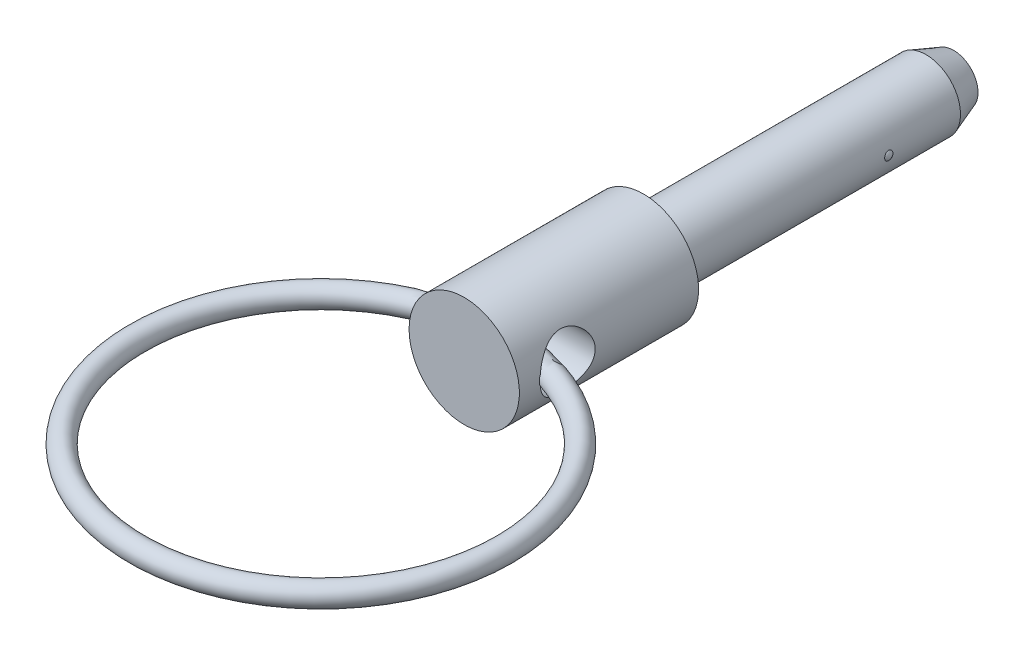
ISO-10303-21;
HEADER;
FILE_DESCRIPTION(('STEP AP214'),'2;1');
FILE_NAME('part.step','',(''),(''),'','','');
FILE_SCHEMA(('AUTOMOTIVE_DESIGN { 1 0 10303 214 1 1 1 1 }'));
ENDSEC;
DATA;
#1=APPLICATION_CONTEXT('core data for automotive mechanical design processes');
#2=APPLICATION_PROTOCOL_DEFINITION('international standard','automotive_design',2000,#1);
#3=PRODUCT_CONTEXT('',#1,'mechanical');
#4=PRODUCT('Part','Part','',(#3));
#5=PRODUCT_RELATED_PRODUCT_CATEGORY('part','',(#4));
#6=PRODUCT_DEFINITION_FORMATION('','',#4);
#7=PRODUCT_DEFINITION_CONTEXT('part definition',#1,'design');
#8=PRODUCT_DEFINITION('design','',#6,#7);
#9=PRODUCT_DEFINITION_SHAPE('','',#8);
#10=(LENGTH_UNIT() NAMED_UNIT(*) SI_UNIT(.MILLI.,.METRE.));
#11=(NAMED_UNIT(*) PLANE_ANGLE_UNIT() SI_UNIT($,.RADIAN.));
#12=(NAMED_UNIT(*) SI_UNIT($,.STERADIAN.) SOLID_ANGLE_UNIT());
#13=UNCERTAINTY_MEASURE_WITH_UNIT(LENGTH_MEASURE(1.E-05),#10,'distance_accuracy_value','');
#14=(GEOMETRIC_REPRESENTATION_CONTEXT(3) GLOBAL_UNCERTAINTY_ASSIGNED_CONTEXT((#13)) GLOBAL_UNIT_ASSIGNED_CONTEXT((#10,
#11,#12)) REPRESENTATION_CONTEXT('',''));
#15=CARTESIAN_POINT('',(0.,0.,0.));
#16=DIRECTION('',(0.,0.,1.));
#17=DIRECTION('',(1.,0.,0.));
#18=AXIS2_PLACEMENT_3D('',#15,#16,#17);
#19=CARTESIAN_POINT('',(0.,0.,14.9758741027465));
#20=DIRECTION('',(0.,0.,1.));
#21=DIRECTION('',(-1.,0.,0.));
#22=AXIS2_PLACEMENT_3D('',#19,#20,#21);
#23=CYLINDRICAL_SURFACE('',#22,4.00000000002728);
#24=CARTESIAN_POINT('',(0.,0.,12.9999999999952));
#25=DIRECTION('',(0.,0.,1.));
#26=DIRECTION('',(-1.,0.,0.));
#27=AXIS2_PLACEMENT_3D('',#24,#25,#26);
#28=CIRCLE('',#27,4.00000000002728);
#29=CARTESIAN_POINT('',(-4.00000000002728,0.,12.9999999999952));
#30=VERTEX_POINT('',#29);
#31=EDGE_CURVE('E68',#30,#30,#28,.T.);
#32=ORIENTED_EDGE('',*,*,#31,.F.);
#33=EDGE_LOOP('',(#32));
#34=FACE_BOUND('',#33,.T.);
#35=CARTESIAN_POINT('',(0.,0.,2.90531487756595E-11));
#36=DIRECTION('',(0.,0.,1.));
#37=DIRECTION('',(-1.,0.,0.));
#38=AXIS2_PLACEMENT_3D('',#35,#36,#37);
#39=CIRCLE('',#38,4.00000000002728);
#40=CARTESIAN_POINT('',(-4.00000000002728,0.,2.90531487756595E-11));
#41=VERTEX_POINT('',#40);
#42=EDGE_CURVE('E119',#41,#41,#39,.T.);
#43=ORIENTED_EDGE('',*,*,#42,.T.);
#44=EDGE_LOOP('',(#43));
#45=FACE_BOUND('',#44,.T.);
#46=CARTESIAN_POINT('',(3.99005038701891,0.281953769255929,9.92986493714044));
#47=CARTESIAN_POINT('',(3.98710361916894,0.323646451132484,9.94537015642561));
#48=CARTESIAN_POINT('',(3.98358785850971,0.364031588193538,9.96435084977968));
#49=CARTESIAN_POINT('',(3.97580260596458,0.441017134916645,10.008790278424));
#50=CARTESIAN_POINT('',(3.97153248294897,0.47761433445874,10.0342544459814));
#51=CARTESIAN_POINT('',(3.96271650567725,0.545954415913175,10.0909789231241));
#52=CARTESIAN_POINT('',(3.95817071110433,0.577698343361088,10.1222379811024));
#53=CARTESIAN_POINT('',(3.94931125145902,0.635450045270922,10.1896824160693));
#54=CARTESIAN_POINT('',(3.94499753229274,0.661459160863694,10.2258666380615));
#55=CARTESIAN_POINT('',(3.93708131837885,0.707055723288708,10.3020868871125));
#56=CARTESIAN_POINT('',(3.93347801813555,0.726650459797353,10.3421184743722));
#57=CARTESIAN_POINT('',(3.92735611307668,0.759043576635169,10.4249158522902));
#58=CARTESIAN_POINT('',(3.92483759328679,0.771841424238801,10.4676818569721));
#59=CARTESIAN_POINT('',(3.92109281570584,0.79064892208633,10.5555243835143));
#60=CARTESIAN_POINT('',(3.91989028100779,0.79653409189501,10.6006284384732));
#61=CARTESIAN_POINT('',(3.91894269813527,0.801182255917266,10.6912124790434));
#62=CARTESIAN_POINT('',(3.91919799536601,0.79994356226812,10.7366925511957));
#63=CARTESIAN_POINT('',(3.92114297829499,0.79035624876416,10.829192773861));
#64=CARTESIAN_POINT('',(3.92290466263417,0.781650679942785,10.8761742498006));
#65=CARTESIAN_POINT('',(3.92772482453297,0.757055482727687,10.9681516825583));
#66=CARTESIAN_POINT('',(3.93078377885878,0.741163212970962,11.0131469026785));
#67=CARTESIAN_POINT('',(3.93806499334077,0.70148030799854,11.1026764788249));
#68=CARTESIAN_POINT('',(3.94234583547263,0.677274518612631,11.1470226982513));
#69=CARTESIAN_POINT('',(3.95147153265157,0.621820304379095,11.2310343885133));
#70=CARTESIAN_POINT('',(3.95631656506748,0.590569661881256,11.2706983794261));
#71=CARTESIAN_POINT('',(3.9660181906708,0.5214609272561,11.3441933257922));
#72=CARTESIAN_POINT('',(3.97087472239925,0.483570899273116,11.3779944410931));
#73=CARTESIAN_POINT('',(3.97994547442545,0.402125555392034,11.4380257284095));
#74=CARTESIAN_POINT('',(3.98416017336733,0.358574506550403,11.4642615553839));
#75=CARTESIAN_POINT('',(3.99101820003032,0.271145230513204,11.5057266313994));
#76=CARTESIAN_POINT('',(3.99376828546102,0.227643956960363,11.5217298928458));
#77=CARTESIAN_POINT('',(3.9978554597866,0.138347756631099,11.5452375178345));
#78=CARTESIAN_POINT('',(3.99919394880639,0.0925551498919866,11.5527503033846));
#79=CARTESIAN_POINT('',(4.00020492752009,0.00564920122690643,11.5584330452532));
#80=CARTESIAN_POINT('',(4.00005022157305,-0.0354012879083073,11.5575719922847));
#81=CARTESIAN_POINT('',(3.99850330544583,-0.116721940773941,11.5488508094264));
#82=CARTESIAN_POINT('',(3.99711125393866,-0.156992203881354,11.5409915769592));
#83=CARTESIAN_POINT('',(3.99330536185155,-0.23447092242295,11.5190218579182));
#84=CARTESIAN_POINT('',(3.99092186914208,-0.271733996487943,11.5050965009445));
#85=CARTESIAN_POINT('',(3.98537855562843,-0.343596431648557,11.4716692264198));
#86=CARTESIAN_POINT('',(3.98221855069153,-0.378195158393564,11.4521659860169));
#87=CARTESIAN_POINT('',(3.97515535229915,-0.446551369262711,11.4066625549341));
#88=CARTESIAN_POINT('',(3.97121432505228,-0.48005403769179,11.380286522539));
#89=CARTESIAN_POINT('',(3.96314004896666,-0.542697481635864,11.3228119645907));
#90=CARTESIAN_POINT('',(3.95900671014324,-0.57183618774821,11.2917112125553));
#91=CARTESIAN_POINT('',(3.95044956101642,-0.628376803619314,11.2218573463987));
#92=CARTESIAN_POINT('',(3.94604615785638,-0.655204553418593,11.1826362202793));
#93=CARTESIAN_POINT('',(3.93791011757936,-0.702452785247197,11.1004353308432));
#94=CARTESIAN_POINT('',(3.93417778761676,-0.722870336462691,11.0574538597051));
#95=CARTESIAN_POINT('',(3.92755557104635,-0.758058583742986,10.9655943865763));
#96=CARTESIAN_POINT('',(3.92474503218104,-0.77232094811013,10.9165145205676));
#97=CARTESIAN_POINT('',(3.92073635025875,-0.792422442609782,10.8165862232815));
#98=CARTESIAN_POINT('',(3.91953811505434,-0.79826205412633,10.765737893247));
#99=CARTESIAN_POINT('',(3.91896964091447,-0.801049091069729,10.6645522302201));
#100=CARTESIAN_POINT('',(3.91957166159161,-0.798131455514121,10.6142190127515));
#101=CARTESIAN_POINT('',(3.92252995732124,-0.783463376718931,10.5149080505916));
#102=CARTESIAN_POINT('',(3.9248854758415,-0.771716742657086,10.4659297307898));
#103=CARTESIAN_POINT('',(3.93088557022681,-0.740520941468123,10.3740211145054));
#104=CARTESIAN_POINT('',(3.93443961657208,-0.721603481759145,10.3309041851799));
#105=CARTESIAN_POINT('',(3.94243966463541,-0.67652841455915,10.2487285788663));
#106=CARTESIAN_POINT('',(3.94688545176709,-0.650372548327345,10.2096689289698));
#107=CARTESIAN_POINT('',(3.95592540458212,-0.592842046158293,10.138445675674));
#108=CARTESIAN_POINT('',(3.96050463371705,-0.561744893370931,10.1060555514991));
#109=CARTESIAN_POINT('',(3.96946431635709,-0.494471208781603,10.0470379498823));
#110=CARTESIAN_POINT('',(3.97384478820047,-0.458295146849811,10.0204099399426));
#111=CARTESIAN_POINT('',(3.98187371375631,-0.382266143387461,9.97385565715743));
#112=CARTESIAN_POINT('',(3.98552868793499,-0.342451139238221,9.95386848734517));
#113=CARTESIAN_POINT('',(3.9917566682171,-0.259975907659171,9.92075319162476));
#114=CARTESIAN_POINT('',(3.99432946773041,-0.217315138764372,9.90762637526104));
#115=CARTESIAN_POINT('',(3.99811926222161,-0.130195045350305,9.88852098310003));
#116=CARTESIAN_POINT('',(3.99933102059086,-0.0857294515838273,9.88257000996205));
#117=CARTESIAN_POINT('',(4.00024701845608,0.00356373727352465,9.87805708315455));
#118=CARTESIAN_POINT('',(3.9999525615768,0.0483909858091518,9.8794887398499));
#119=CARTESIAN_POINT('',(3.99817522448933,0.125082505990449,9.88829599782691));
#120=CARTESIAN_POINT('',(3.99703656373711,0.157163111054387,9.8939529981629));
#121=CARTESIAN_POINT('',(3.99404982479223,0.220379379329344,9.90907748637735));
#122=CARTESIAN_POINT('',(3.9922017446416,0.251515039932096,9.91854498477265));
#123=CARTESIAN_POINT('',(3.99005038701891,0.281953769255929,9.92986493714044));
#124=B_SPLINE_CURVE_WITH_KNOTS('',3,(#46,#47,#48,#49,#50,#51,#52,#53,#54,#55,#56,#57,#58,#59,
#60,#61,#62,#63,#64,#65,#66,#67,#68,#69,#70,#71,#72,#73,#74,#75,#76,#77,#78,#79,#80,#81,#82,#83,
#84,#85,#86,#87,#88,#89,#90,#91,#92,#93,#94,#95,#96,#97,#98,#99,#100,#101,#102,#103,#104,#105,
#106,#107,#108,#109,#110,#111,#112,#113,#114,#115,#116,#117,#118,#119,#120,#121,#122,#123),
.UNSPECIFIED.,.T.,.F.,(4,2,2,2,2,2,2,2,2,2,2,2,2,2,2,2,2,2,2,2,2,2,2,2,2,2,2,2,2,2,2,2,2,2,2,2,
2,2,4),(0.,0.13362272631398,0.267357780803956,0.40106398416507,0.534738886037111,
0.668261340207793,0.801794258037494,0.937696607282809,1.07363115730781,1.2164509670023,
1.35932331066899,1.5107314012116,1.66218722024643,1.8143926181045,1.96648394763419,
2.1049852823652,2.24334911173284,2.36591145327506,2.488458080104,2.60750142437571,
2.72657302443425,2.85451767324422,2.98252280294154,3.12508196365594,3.26770620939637,
3.42053145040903,3.57334795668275,3.72382188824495,3.87423093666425,4.01516707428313,
4.15606933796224,4.29082406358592,4.42556633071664,4.55903651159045,4.69253216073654,
4.82653969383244,4.96043126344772,5.05798542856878,5.15553986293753),.UNSPECIFIED.);
#125=CARTESIAN_POINT('',(3.98515545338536,0.344290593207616,11.4701431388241));
#126=VERTEX_POINT('',#125);
#127=CARTESIAN_POINT('',(3.9851554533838,-0.344290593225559,11.4701431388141));
#128=VERTEX_POINT('',#127);
#129=EDGE_CURVE('E40',#126,#128,#124,.T.);
#130=ORIENTED_EDGE('',*,*,#129,.F.);
#131=CARTESIAN_POINT('',(3.46410161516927,-2.,9.5));
#132=CARTESIAN_POINT('',(3.46411185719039,-1.99999158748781,9.39578679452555));
#133=CARTESIAN_POINT('',(3.46887633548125,-1.99179963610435,9.29143782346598));
#134=CARTESIAN_POINT('',(3.48724701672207,-1.95944672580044,9.08594482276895));
#135=CARTESIAN_POINT('',(3.50087179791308,-1.93525221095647,8.98480799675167));
#136=CARTESIAN_POINT('',(3.53498701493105,-1.87219981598,8.78909684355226));
#137=CARTESIAN_POINT('',(3.55544089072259,-1.83341988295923,8.69449074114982));
#138=CARTESIAN_POINT('',(3.60085327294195,-1.74253507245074,8.51315154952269));
#139=CARTESIAN_POINT('',(3.62581202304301,-1.6904294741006,8.42641888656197));
#140=CARTESIAN_POINT('',(3.679937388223,-1.56933307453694,8.25538855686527));
#141=CARTESIAN_POINT('',(3.70928127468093,-1.49930407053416,8.1718817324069));
#142=CARTESIAN_POINT('',(3.76743965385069,-1.34650761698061,8.01718321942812));
#143=CARTESIAN_POINT('',(3.79625387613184,-1.26373385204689,7.94599767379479));
#144=CARTESIAN_POINT('',(3.8524295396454,-1.080979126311,7.81326569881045));
#145=CARTESIAN_POINT('',(3.879562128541,-0.980214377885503,7.75269246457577));
#146=CARTESIAN_POINT('',(3.92701512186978,-0.768314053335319,7.64971829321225));
#147=CARTESIAN_POINT('',(3.94733982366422,-0.657185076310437,7.60730588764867));
#148=CARTESIAN_POINT('',(3.97760922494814,-0.436089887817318,7.54499067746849));
#149=CARTESIAN_POINT('',(3.98818960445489,-0.326603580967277,7.52370094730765));
#150=CARTESIAN_POINT('',(4.00015167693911,-0.105141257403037,7.49966776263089));
#151=CARTESIAN_POINT('',(4.00153893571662,0.00683321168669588,7.49691308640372));
#152=CARTESIAN_POINT('',(3.99525963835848,0.21966504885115,7.50949334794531));
#153=CARTESIAN_POINT('',(3.98836991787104,0.320642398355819,7.5232760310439));
#154=CARTESIAN_POINT('',(3.96748490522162,0.51862754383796,7.56576168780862));
#155=CARTESIAN_POINT('',(3.95348908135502,0.615635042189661,7.59446577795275));
#156=CARTESIAN_POINT('',(3.91943166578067,0.804618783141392,7.66616513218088));
#157=CARTESIAN_POINT('',(3.89928883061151,0.896506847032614,7.70935262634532));
#158=CARTESIAN_POINT('',(3.85475291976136,1.07195360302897,7.80852683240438));
#159=CARTESIAN_POINT('',(3.83035832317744,1.15550929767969,7.86451812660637));
#160=CARTESIAN_POINT('',(3.77688788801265,1.32034732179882,7.99379070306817));
#161=CARTESIAN_POINT('',(3.74758751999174,1.40066815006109,8.06820605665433));
#162=CARTESIAN_POINT('',(3.68908681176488,1.54820874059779,8.22917944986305));
#163=CARTESIAN_POINT('',(3.65988656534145,1.6154184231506,8.31574674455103));
#164=CARTESIAN_POINT('',(3.60288312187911,1.73901066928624,8.50529638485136));
#165=CARTESIAN_POINT('',(3.57528639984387,1.79443462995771,8.60897204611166));
#166=CARTESIAN_POINT('',(3.52750900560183,1.88663822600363,8.82587534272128));
#167=CARTESIAN_POINT('',(3.50732060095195,1.92343731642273,8.9390928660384));
#168=CARTESIAN_POINT('',(3.47889271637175,1.97436042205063,9.1624290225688));
#169=CARTESIAN_POINT('',(3.46983311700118,1.99005024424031,9.27208223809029));
#170=CARTESIAN_POINT('',(3.46235838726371,2.00303389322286,9.49280268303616));
#171=CARTESIAN_POINT('',(3.46393573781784,2.00034071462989,9.60386885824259));
#172=CARTESIAN_POINT('',(3.47668673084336,1.97807208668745,9.81130783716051));
#173=CARTESIAN_POINT('',(3.48679175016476,1.96037563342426,9.90795890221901));
#174=CARTESIAN_POINT('',(3.51388043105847,1.91139256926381,10.0967355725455));
#175=CARTESIAN_POINT('',(3.5308663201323,1.88010155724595,10.1888597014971));
#176=CARTESIAN_POINT('',(3.57072444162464,1.80329517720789,10.370822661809));
#177=CARTESIAN_POINT('',(3.59383286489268,1.75718812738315,10.46035803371));
#178=CARTESIAN_POINT('',(3.64312238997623,1.65257412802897,10.6309385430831));
#179=CARTESIAN_POINT('',(3.66930506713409,1.59406080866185,10.7119792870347));
#180=CARTESIAN_POINT('',(3.72575996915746,1.45767433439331,10.8739575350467));
#181=CARTESIAN_POINT('',(3.75613166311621,1.37829054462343,10.9535943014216));
#182=CARTESIAN_POINT('',(3.81468469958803,1.20680899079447,11.0988244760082));
#183=CARTESIAN_POINT('',(3.84286530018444,1.11470694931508,11.1644131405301));
#184=CARTESIAN_POINT('',(3.89482723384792,0.917070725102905,11.2811474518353));
#185=CARTESIAN_POINT('',(3.91847283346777,0.811246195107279,11.3318662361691));
#186=CARTESIAN_POINT('',(3.95766709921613,0.591044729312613,11.4142758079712));
#187=CARTESIAN_POINT('',(3.97322287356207,0.476675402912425,11.4459833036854));
#188=CARTESIAN_POINT('',(3.99335016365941,0.253959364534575,11.4867371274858));
#189=CARTESIAN_POINT('',(3.99879855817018,0.146022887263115,11.4975957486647));
#190=CARTESIAN_POINT('',(4.00084260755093,-0.0702519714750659,11.5016865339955));
#191=CARTESIAN_POINT('',(3.99744136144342,-0.178590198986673,11.4949248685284));
#192=CARTESIAN_POINT('',(3.98267937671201,-0.385075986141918,11.4651671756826));
#193=CARTESIAN_POINT('',(3.97185789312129,-0.483424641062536,11.4432702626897));
#194=CARTESIAN_POINT('',(3.94384187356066,-0.674891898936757,11.3853460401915));
#195=CARTESIAN_POINT('',(3.92664642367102,-0.768009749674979,11.3493167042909));
#196=CARTESIAN_POINT('',(3.88651861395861,-0.950846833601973,11.2625457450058));
#197=CARTESIAN_POINT('',(3.86337234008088,-1.04025036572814,11.211240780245));
#198=CARTESIAN_POINT('',(3.81376266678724,-1.20954920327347,11.096084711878));
#199=CARTESIAN_POINT('',(3.78729774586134,-1.28944011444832,11.0322278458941));
#200=CARTESIAN_POINT('',(3.73057218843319,-1.44582833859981,10.8864033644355));
#201=CARTESIAN_POINT('',(3.70019591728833,-1.52119665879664,10.8032658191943));
#202=CARTESIAN_POINT('',(3.64126158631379,-1.65732528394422,10.6251077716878));
#203=CARTESIAN_POINT('',(3.6127051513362,-1.71807266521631,10.530076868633));
#204=CARTESIAN_POINT('',(3.55999186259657,-1.82486714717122,10.3266911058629));
#205=CARTESIAN_POINT('',(3.5360025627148,-1.8703890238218,10.2180100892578));
#206=CARTESIAN_POINT('',(3.50696218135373,-1.92395929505,10.0494218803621));
#207=CARTESIAN_POINT('',(3.49844389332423,-1.93935666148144,9.99235217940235));
#208=CARTESIAN_POINT('',(3.48406059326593,-1.96508069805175,9.87676744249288));
#209=CARTESIAN_POINT('',(3.47819372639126,-1.97541091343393,9.81825344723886));
#210=CARTESIAN_POINT('',(3.47059023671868,-1.9887293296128,9.71639921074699));
#211=CARTESIAN_POINT('',(3.46816389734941,-1.99295091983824,9.67326694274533));
#212=CARTESIAN_POINT('',(3.46491740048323,-1.99858810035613,9.5867643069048));
#213=CARTESIAN_POINT('',(3.46409735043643,-2.00000350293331,9.54339392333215));
#214=CARTESIAN_POINT('',(3.46410161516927,-2.,9.5));
#215=B_SPLINE_CURVE_WITH_KNOTS('',3,(#131,#132,#133,#134,#135,#136,#137,#138,#139,#140,#141,
#142,#143,#144,#145,#146,#147,#148,#149,#150,#151,#152,#153,#154,#155,#156,#157,#158,#159,#160,
#161,#162,#163,#164,#165,#166,#167,#168,#169,#170,#171,#172,#173,#174,#175,#176,#177,#178,#179,
#180,#181,#182,#183,#184,#185,#186,#187,#188,#189,#190,#191,#192,#193,#194,#195,#196,#197,#198,
#199,#200,#201,#202,#203,#204,#205,#206,#207,#208,#209,#210,#211,#212,#213,#214),.UNSPECIFIED.,
.T.,.F.,(4,2,2,2,2,2,2,2,2,2,2,2,2,2,2,2,2,2,2,2,2,2,2,2,2,2,2,2,2,2,2,2,2,2,2,2,2,2,2,2,2,4),
(0.,0.312464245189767,0.625585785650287,0.937057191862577,1.24854545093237,1.58572462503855,
1.92307142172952,2.283157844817,2.64301653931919,2.97726969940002,3.31132047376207,
3.61632194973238,3.92134625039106,4.23059069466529,4.53994598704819,4.87854382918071,
5.21740096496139,5.57777683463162,5.93777548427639,6.26924581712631,6.60048186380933,
6.89548366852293,7.19058104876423,7.49934592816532,7.80826972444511,8.15613487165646,
8.50411729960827,8.8612836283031,9.21813559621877,9.54224540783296,9.86624173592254,
10.1688884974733,10.4715786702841,10.7872150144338,11.1029966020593,11.4502048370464,
11.7977188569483,12.1562149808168,12.3351395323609,12.513938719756,12.6440387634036,
12.7741475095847),.UNSPECIFIED.);
#216=EDGE_CURVE('E52',#128,#126,#215,.T.);
#217=ORIENTED_EDGE('',*,*,#216,.F.);
#218=EDGE_LOOP('',(#130,#217));
#219=FACE_BOUND('',#218,.T.);
#220=CARTESIAN_POINT('',(-3.99005038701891,0.28195376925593,9.92986493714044));
#221=CARTESIAN_POINT('',(-3.99300741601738,0.240095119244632,9.91430139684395));
#222=CARTESIAN_POINT('',(-3.99539394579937,0.196873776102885,9.90222423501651));
#223=CARTESIAN_POINT('',(-3.99875840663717,0.10894998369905,9.88535960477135));
#224=CARTESIAN_POINT('',(-3.99973502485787,0.0642461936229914,9.88057893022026));
#225=CARTESIAN_POINT('',(-4.00017032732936,-0.025331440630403,9.87843698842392));
#226=CARTESIAN_POINT('',(-3.99962961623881,-0.0702052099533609,9.88107276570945));
#227=CARTESIAN_POINT('',(-3.99709040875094,-0.158855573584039,9.89369477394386));
#228=CARTESIAN_POINT('',(-3.99509218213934,-0.202632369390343,9.90367964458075));
#229=CARTESIAN_POINT('',(-3.9898570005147,-0.287863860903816,9.93075746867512));
#230=CARTESIAN_POINT('',(-3.98661975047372,-0.329318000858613,9.94785211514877));
#231=CARTESIAN_POINT('',(-3.97926488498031,-0.408707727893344,9.98872052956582));
#232=CARTESIAN_POINT('',(-3.97514726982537,-0.446643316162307,10.0124942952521));
#233=CARTESIAN_POINT('',(-3.96650501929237,-0.517804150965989,10.0660180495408));
#234=CARTESIAN_POINT('',(-3.96198162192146,-0.551042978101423,10.0957501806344));
#235=CARTESIAN_POINT('',(-3.95302385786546,-0.612008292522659,10.1604189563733));
#236=CARTESIAN_POINT('',(-3.94858948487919,-0.639735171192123,10.1953552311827));
#237=CARTESIAN_POINT('',(-3.94031345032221,-0.688877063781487,10.2693392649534));
#238=CARTESIAN_POINT('',(-3.93647024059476,-0.710308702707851,10.3083758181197));
#239=CARTESIAN_POINT('',(-3.92977370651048,-0.746470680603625,10.3895111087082));
#240=CARTESIAN_POINT('',(-3.92692040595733,-0.761200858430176,10.4316099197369));
#241=CARTESIAN_POINT('',(-3.92245555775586,-0.783887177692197,10.5182713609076));
#242=CARTESIAN_POINT('',(-3.92086162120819,-0.791747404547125,10.5628599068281));
#243=CARTESIAN_POINT('',(-3.91911143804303,-0.800365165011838,10.652740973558));
#244=CARTESIAN_POINT('',(-3.91895550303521,-0.80112115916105,10.698033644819));
#245=CARTESIAN_POINT('',(-3.92007796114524,-0.795611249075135,10.7902748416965));
#246=CARTESIAN_POINT('',(-3.92142316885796,-0.789018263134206,10.837202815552));
#247=CARTESIAN_POINT('',(-3.92546548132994,-0.768652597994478,10.9294151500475));
#248=CARTESIAN_POINT('',(-3.92816306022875,-0.754877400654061,10.9746989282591));
#249=CARTESIAN_POINT('',(-3.93479992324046,-0.719508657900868,11.0652695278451));
#250=CARTESIAN_POINT('',(-3.93880557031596,-0.697485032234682,11.1103840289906));
#251=CARTESIAN_POINT('',(-3.94752061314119,-0.646337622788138,11.196342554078));
#252=CARTESIAN_POINT('',(-3.95223026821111,-0.617211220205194,11.2371849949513));
#253=CARTESIAN_POINT('',(-3.96188534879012,-0.551879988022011,11.3139586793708));
#254=CARTESIAN_POINT('',(-3.96683340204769,-0.515564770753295,11.349796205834));
#255=CARTESIAN_POINT('',(-3.97625988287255,-0.43694196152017,11.414255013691));
#256=CARTESIAN_POINT('',(-3.98073857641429,-0.394637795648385,11.4428803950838));
#257=CARTESIAN_POINT('',(-3.98829005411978,-0.30863677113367,11.4895001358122));
#258=CARTESIAN_POINT('',(-3.99144495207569,-0.265302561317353,11.5081469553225));
#259=CARTESIAN_POINT('',(-3.99638413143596,-0.175817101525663,11.5368761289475));
#260=CARTESIAN_POINT('',(-3.99816989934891,-0.129668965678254,11.5469677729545));
#261=CARTESIAN_POINT('',(-3.99999419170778,-0.0417967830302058,11.5572584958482));
#262=CARTESIAN_POINT('',(-4.00021432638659,-0.000194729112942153,11.5584860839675));
#263=CARTESIAN_POINT('',(-3.99936155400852,0.0825703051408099,11.5536924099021));
#264=CARTESIAN_POINT('',(-3.9982889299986,0.123733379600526,11.5476727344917));
#265=CARTESIAN_POINT('',(-3.99505363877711,0.202575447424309,11.5291543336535));
#266=CARTESIAN_POINT('',(-3.99294152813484,0.24032798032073,11.5169554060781));
#267=CARTESIAN_POINT('',(-3.98787194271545,0.31340150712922,11.4868260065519));
#268=CARTESIAN_POINT('',(-3.98491430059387,0.348722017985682,11.4688943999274));
#269=CARTESIAN_POINT('',(-3.97822434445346,0.418368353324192,11.4267056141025));
#270=CARTESIAN_POINT('',(-3.9744550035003,0.452491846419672,11.4021214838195));
#271=CARTESIAN_POINT('',(-3.96662805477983,0.516631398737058,11.3481231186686));
#272=CARTESIAN_POINT('',(-3.96257031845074,0.546645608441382,11.3187067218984));
#273=CARTESIAN_POINT('',(-3.9540631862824,0.605276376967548,11.2522992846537));
#274=CARTESIAN_POINT('',(-3.94962143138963,0.633350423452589,11.214827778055));
#275=CARTESIAN_POINT('',(-3.9412701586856,0.68339933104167,11.135950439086));
#276=CARTESIAN_POINT('',(-3.93736090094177,0.705371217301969,11.0945427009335));
#277=CARTESIAN_POINT('',(-3.93019522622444,0.744305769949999,11.0052774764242));
#278=CARTESIAN_POINT('',(-3.9270182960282,0.760712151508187,10.9571694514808));
#279=CARTESIAN_POINT('',(-3.92216984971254,0.785329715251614,10.8588172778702));
#280=CARTESIAN_POINT('',(-3.92049838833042,0.793540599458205,10.8085730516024));
#281=CARTESIAN_POINT('',(-3.91892501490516,0.801276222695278,10.7075574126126));
#282=CARTESIAN_POINT('',(-3.91901674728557,0.800832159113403,10.6567885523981));
#283=CARTESIAN_POINT('',(-3.92100845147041,0.791023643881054,10.5561554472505));
#284=CARTESIAN_POINT('',(-3.9229076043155,0.7816632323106,10.5062908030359));
#285=CARTESIAN_POINT('',(-3.9281461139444,0.754877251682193,10.4121456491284));
#286=CARTESIAN_POINT('',(-3.93139064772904,0.737977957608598,10.3677100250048));
#287=CARTESIAN_POINT('',(-3.93892368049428,0.696648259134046,10.2825763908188));
#288=CARTESIAN_POINT('',(-3.94321208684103,0.672218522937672,10.2418780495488));
#289=CARTESIAN_POINT('',(-3.95208501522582,0.617853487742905,10.1674080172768));
#290=CARTESIAN_POINT('',(-3.95664517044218,0.588241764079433,10.1333964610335));
#291=CARTESIAN_POINT('',(-3.96570971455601,0.523645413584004,10.0709664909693));
#292=CARTESIAN_POINT('',(-3.97021415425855,0.488666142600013,10.0425425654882));
#293=CARTESIAN_POINT('',(-3.97742706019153,0.425180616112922,9.99940040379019));
#294=CARTESIAN_POINT('',(-3.9802769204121,0.39774932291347,9.98310007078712));
#295=CARTESIAN_POINT('',(-3.98553180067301,0.341095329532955,9.95389443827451));
#296=CARTESIAN_POINT('',(-3.9879368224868,0.311872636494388,9.94098912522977));
#297=CARTESIAN_POINT('',(-3.99005038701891,0.28195376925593,9.92986493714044));
#298=B_SPLINE_CURVE_WITH_KNOTS('',3,(#220,#221,#222,#223,#224,#225,#226,#227,#228,#229,#230,
#231,#232,#233,#234,#235,#236,#237,#238,#239,#240,#241,#242,#243,#244,#245,#246,#247,#248,#249,
#250,#251,#252,#253,#254,#255,#256,#257,#258,#259,#260,#261,#262,#263,#264,#265,#266,#267,#268,
#269,#270,#271,#272,#273,#274,#275,#276,#277,#278,#279,#280,#281,#282,#283,#284,#285,#286,#287,
#288,#289,#290,#291,#292,#293,#294,#295,#296,#297),.UNSPECIFIED.,.T.,.F.,(4,2,2,2,2,2,2,2,2,2,2,
2,2,2,2,2,2,2,2,2,2,2,2,2,2,2,2,2,2,2,2,2,2,2,2,2,2,2,4),(0.,0.134152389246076,
0.268429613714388,0.402653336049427,0.536852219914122,0.671083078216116,0.805313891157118,
0.939148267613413,1.07297313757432,1.20644134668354,1.33991276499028,1.4752191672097,
1.61055488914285,1.75216328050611,1.89382135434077,2.04422271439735,2.19467961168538,
2.34765655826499,2.50054634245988,2.64157513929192,2.78245059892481,2.90667081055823,
3.03086382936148,3.14953805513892,3.26823578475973,3.39440010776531,3.52062102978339,
3.66112536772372,3.80169808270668,3.95376166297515,4.10583077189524,4.25735183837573,
4.4088042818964,4.55102684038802,4.6932367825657,4.82856596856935,4.96376098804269,
5.05964806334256,5.15553475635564),.UNSPECIFIED.);
#299=CARTESIAN_POINT('',(-3.98515545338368,-0.344290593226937,11.4701431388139));
#300=VERTEX_POINT('',#299);
#301=CARTESIAN_POINT('',(-3.98515545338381,0.344290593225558,11.4701431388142));
#302=VERTEX_POINT('',#301);
#303=EDGE_CURVE('E56',#300,#302,#298,.T.);
#304=ORIENTED_EDGE('',*,*,#303,.F.);
#305=CARTESIAN_POINT('',(-4.00000000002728,0.,7.5));
#306=CARTESIAN_POINT('',(-3.9999942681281,-0.105143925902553,7.50000660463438));
#307=CARTESIAN_POINT('',(-3.99580982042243,-0.2104131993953,7.50834014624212));
#308=CARTESIAN_POINT('',(-3.97948312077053,-0.417840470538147,7.54130576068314));
#309=CARTESIAN_POINT('',(-3.96732575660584,-0.519992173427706,7.56596878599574));
#310=CARTESIAN_POINT('',(-3.93632558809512,-0.717867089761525,7.63038761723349));
#311=CARTESIAN_POINT('',(-3.91750878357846,-0.81361360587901,7.67008476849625));
#312=CARTESIAN_POINT('',(-3.87491553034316,-0.996945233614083,7.76314124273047));
#313=CARTESIAN_POINT('',(-3.85113947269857,-1.08453098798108,7.81649948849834));
#314=CARTESIAN_POINT('',(-3.79912516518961,-1.25501563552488,7.93903449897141));
#315=CARTESIAN_POINT('',(-3.7707039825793,-1.33731042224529,8.00897295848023));
#316=CARTESIAN_POINT('',(-3.71319940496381,-1.48955888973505,8.16104295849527));
#317=CARTESIAN_POINT('',(-3.68411552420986,-1.55950316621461,8.24318370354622));
#318=CARTESIAN_POINT('',(-3.6259790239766,-1.6905040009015,8.42496669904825));
#319=CARTESIAN_POINT('',(-3.59710373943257,-1.75045067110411,8.52547219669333));
#320=CARTESIAN_POINT('',(-3.54571957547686,-1.852336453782,8.73673467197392));
#321=CARTESIAN_POINT('',(-3.5232061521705,-1.89428842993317,8.84748425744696));
#322=CARTESIAN_POINT('',(-3.48915734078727,-1.95626488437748,9.06933021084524));
#323=CARTESIAN_POINT('',(-3.47704543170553,-1.9774517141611,9.18000890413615));
#324=CARTESIAN_POINT('',(-3.46363779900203,-2.00085398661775,9.40395767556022));
#325=CARTESIAN_POINT('',(-3.46233138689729,-2.00308817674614,9.51722508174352));
#326=CARTESIAN_POINT('',(-3.4702186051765,-1.98937457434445,9.72857204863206));
#327=CARTESIAN_POINT('',(-3.47817527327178,-1.97556911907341,9.82684806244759));
#328=CARTESIAN_POINT('',(-3.50152457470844,-1.93387969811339,10.0194438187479));
#329=CARTESIAN_POINT('',(-3.51691957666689,-1.90599124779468,10.1137622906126));
#330=CARTESIAN_POINT('',(-3.55374952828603,-1.83641956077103,10.2984582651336));
#331=CARTESIAN_POINT('',(-3.57531681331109,-1.79443013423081,10.388692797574));
#332=CARTESIAN_POINT('',(-3.62206808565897,-1.69808337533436,10.5612685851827));
#333=CARTESIAN_POINT('',(-3.64725369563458,-1.64372048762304,10.6436062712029));
#334=CARTESIAN_POINT('',(-3.70226315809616,-1.51613210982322,10.8090425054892));
#335=CARTESIAN_POINT('',(-3.73227020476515,-1.441388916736,10.890913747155));
#336=CARTESIAN_POINT('',(-3.79095246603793,-1.2791111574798,11.0414708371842));
#337=CARTESIAN_POINT('',(-3.81962703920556,-1.19157051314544,11.1101503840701));
#338=CARTESIAN_POINT('',(-3.87403974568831,-1.00103301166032,11.2353713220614));
#339=CARTESIAN_POINT('',(-3.89957968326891,-0.897507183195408,11.2912009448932));
#340=CARTESIAN_POINT('',(-3.94315762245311,-0.680932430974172,11.3841940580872));
#341=CARTESIAN_POINT('',(-3.96120157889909,-0.567891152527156,11.4213723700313));
#342=CARTESIAN_POINT('',(-3.98648667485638,-0.345532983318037,11.4729508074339));
#343=CARTESIAN_POINT('',(-3.99449876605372,-0.236683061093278,11.488982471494));
#344=CARTESIAN_POINT('',(-4.00146026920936,-0.0175591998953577,11.502929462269));
#345=CARTESIAN_POINT('',(-4.00041397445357,0.0927140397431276,11.5008533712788));
#346=CARTESIAN_POINT('',(-3.98982384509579,0.302465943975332,11.479586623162));
#347=CARTESIAN_POINT('',(-3.98094491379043,0.402118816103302,11.4617349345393));
#348=CARTESIAN_POINT('',(-3.95644342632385,0.596813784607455,11.4115238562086));
#349=CARTESIAN_POINT('',(-3.94082012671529,0.691855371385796,11.3791628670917));
#350=CARTESIAN_POINT('',(-3.90368502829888,0.877777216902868,11.3000030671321));
#351=CARTESIAN_POINT('',(-3.88201763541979,0.968460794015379,11.2528178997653));
#352=CARTESIAN_POINT('',(-3.83487948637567,1.14092272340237,11.1457849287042));
#353=CARTESIAN_POINT('',(-3.80940711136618,1.22269725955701,11.0859317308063));
#354=CARTESIAN_POINT('',(-3.75416442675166,1.38353537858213,10.948479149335));
#355=CARTESIAN_POINT('',(-3.72421769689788,1.46154415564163,10.8697142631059));
#356=CARTESIAN_POINT('',(-3.66524783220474,1.60371264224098,10.7001496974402));
#357=CARTESIAN_POINT('',(-3.63622534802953,1.66786277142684,10.6093417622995));
#358=CARTESIAN_POINT('',(-3.58102384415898,1.7834158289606,10.412712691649));
#359=CARTESIAN_POINT('',(-3.55505059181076,1.83405099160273,10.306377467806));
#360=CARTESIAN_POINT('',(-3.51148144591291,1.91616565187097,10.0849798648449));
#361=CARTESIAN_POINT('',(-3.49387476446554,1.94766983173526,9.96992894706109));
#362=CARTESIAN_POINT('',(-3.47123002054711,1.98772337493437,9.74617955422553));
#363=CARTESIAN_POINT('',(-3.46514766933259,1.99818599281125,9.6379314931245));
#364=CARTESIAN_POINT('',(-3.46330709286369,2.00137830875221,9.42110586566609));
#365=CARTESIAN_POINT('',(-3.46754439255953,1.99411569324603,9.31252846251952));
#366=CARTESIAN_POINT('',(-3.48475724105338,1.96385225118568,9.10903299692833));
#367=CARTESIAN_POINT('',(-3.49686188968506,1.94241662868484,9.01379905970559));
#368=CARTESIAN_POINT('',(-3.52742032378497,1.88635071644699,8.8283837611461));
#369=CARTESIAN_POINT('',(-3.54587615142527,1.85171618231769,8.73820403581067));
#370=CARTESIAN_POINT('',(-3.58857060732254,1.76763149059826,8.55875029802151));
#371=CARTESIAN_POINT('',(-3.61311444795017,1.71734227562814,8.46994419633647));
#372=CARTESIAN_POINT('',(-3.66470663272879,1.60430194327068,8.30145092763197));
#373=CARTESIAN_POINT('',(-3.69175627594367,1.54154434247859,8.22176853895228));
#374=CARTESIAN_POINT('',(-3.74924646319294,1.3964066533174,8.06371603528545));
#375=CARTESIAN_POINT('',(-3.77969966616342,1.31256884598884,7.98668179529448));
#376=CARTESIAN_POINT('',(-3.83755504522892,1.13230961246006,7.84747403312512));
#377=CARTESIAN_POINT('',(-3.86495557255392,1.03588144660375,7.78530852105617));
#378=CARTESIAN_POINT('',(-3.91396019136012,0.831863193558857,7.67752727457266));
#379=CARTESIAN_POINT('',(-3.93552192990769,0.724199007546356,7.63203166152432));
#380=CARTESIAN_POINT('',(-3.97002682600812,0.501484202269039,7.56038366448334));
#381=CARTESIAN_POINT('',(-3.98299446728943,0.386455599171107,7.53417630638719));
#382=CARTESIAN_POINT('',(-3.9939092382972,0.225203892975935,7.51220517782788));
#383=CARTESIAN_POINT('',(-3.99618730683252,0.180323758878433,7.50763471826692));
#384=CARTESIAN_POINT('',(-3.99923393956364,0.0903034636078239,7.50153066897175));
#385=CARTESIAN_POINT('',(-4.0000024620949,0.0451632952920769,7.49999716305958));
#386=CARTESIAN_POINT('',(-4.00000000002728,0.,7.5));
#387=B_SPLINE_CURVE_WITH_KNOTS('',3,(#305,#306,#307,#308,#309,#310,#311,#312,#313,#314,#315,
#316,#317,#318,#319,#320,#321,#322,#323,#324,#325,#326,#327,#328,#329,#330,#331,#332,#333,#334,
#335,#336,#337,#338,#339,#340,#341,#342,#343,#344,#345,#346,#347,#348,#349,#350,#351,#352,#353,
#354,#355,#356,#357,#358,#359,#360,#361,#362,#363,#364,#365,#366,#367,#368,#369,#370,#371,#372,
#373,#374,#375,#376,#377,#378,#379,#380,#381,#382,#383,#384,#385,#386),.UNSPECIFIED.,.T.,.F.,(4,
2,2,2,2,2,2,2,2,2,2,2,2,2,2,2,2,2,2,2,2,2,2,2,2,2,2,2,2,2,2,2,2,2,2,2,2,2,2,2,4),(0.,
0.315248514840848,0.631096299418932,0.945724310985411,1.26032752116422,1.59396351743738,
1.92785247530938,2.28763452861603,2.64715895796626,2.98516024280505,3.3228271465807,
3.62011424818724,3.91749607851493,4.22180480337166,4.52625042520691,4.86929882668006,
5.21251069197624,5.57166044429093,5.93052433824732,6.25966580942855,6.58865129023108,
6.89213813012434,7.19565843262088,7.50785712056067,7.82018901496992,8.16319221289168,
8.5064317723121,8.86629364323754,9.22569023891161,9.55058615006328,9.87534119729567,
10.1691586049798,10.4630705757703,10.7767291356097,11.0905512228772,11.4425048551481,
11.7946476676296,12.1492802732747,12.5028981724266,12.6383056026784,12.7737167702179),.UNSPECIFIED.);
#388=EDGE_CURVE('E59',#302,#300,#387,.T.);
#389=ORIENTED_EDGE('',*,*,#388,.F.);
#390=EDGE_LOOP('',(#304,#389));
#391=FACE_BOUND('',#390,.T.);
#392=ADVANCED_FACE('F14',(#34,#45,#219,#391),#23,.T.);
#393=CARTESIAN_POINT('',(5.,0.,9.5));
#394=DIRECTION('',(-1.,0.,0.));
#395=DIRECTION('',(0.,-1.,0.));
#396=AXIS2_PLACEMENT_3D('',#393,#394,#395);
#397=CYLINDRICAL_SURFACE('',#396,2.);
#398=ORIENTED_EDGE('',*,*,#388,.T.);
#399=CARTESIAN_POINT('',(-4.01108315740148,-0.369511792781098,11.4655688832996));
#400=CARTESIAN_POINT('',(-3.99021138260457,-0.350083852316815,11.4692147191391));
#401=CARTESIAN_POINT('',(-3.97024619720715,-0.32951681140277,11.4727888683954));
#402=CARTESIAN_POINT('',(-3.93275440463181,-0.285678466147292,11.4796199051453));
#403=CARTESIAN_POINT('',(-3.91527020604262,-0.262370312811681,11.4828710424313));
#404=CARTESIAN_POINT('',(-3.88395406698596,-0.213038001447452,11.4887768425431));
#405=CARTESIAN_POINT('',(-3.87014971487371,-0.186995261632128,11.4914269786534));
#406=CARTESIAN_POINT('',(-3.84773626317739,-0.132819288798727,11.4957673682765));
#407=CARTESIAN_POINT('',(-3.83909292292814,-0.10470125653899,11.4974639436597));
#408=CARTESIAN_POINT('',(-3.82934402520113,-0.0542447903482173,11.4993828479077));
#409=CARTESIAN_POINT('',(-3.82691371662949,-0.0321704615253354,11.499863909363));
#410=CARTESIAN_POINT('',(-3.82579163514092,0.0120958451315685,11.500085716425));
#411=CARTESIAN_POINT('',(-3.8271019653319,0.0342878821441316,11.4998260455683));
#412=CARTESIAN_POINT('',(-3.83333881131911,0.0780566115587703,11.498595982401));
#413=CARTESIAN_POINT('',(-3.83825432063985,0.0996349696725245,11.4976277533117));
#414=CARTESIAN_POINT('',(-3.85128325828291,0.141760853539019,11.4950816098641));
#415=CARTESIAN_POINT('',(-3.85939921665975,0.162307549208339,11.4935032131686));
#416=CARTESIAN_POINT('',(-3.88251041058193,0.210921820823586,11.489056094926));
#417=CARTESIAN_POINT('',(-3.89895987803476,0.2382710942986,11.4859257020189));
#418=CARTESIAN_POINT('',(-3.93589373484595,0.289965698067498,11.4790416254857));
#419=CARTESIAN_POINT('',(-3.95638428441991,0.314306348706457,11.4752869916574));
#420=CARTESIAN_POINT('',(-3.98891907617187,0.348315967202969,11.4694667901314));
#421=CARTESIAN_POINT('',(-3.99986593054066,0.359074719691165,11.467529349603));
#422=CARTESIAN_POINT('',(-4.01108315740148,0.369511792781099,11.4655688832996));
#423=B_SPLINE_CURVE_WITH_KNOTS('',3,(#399,#400,#401,#402,#403,#404,#405,#406,#407,#408,#409,
#410,#411,#412,#413,#414,#415,#416,#417,#418,#419,#420,#421,#422),.UNSPECIFIED.,.F.,.F.,(4,2,2,
2,2,2,2,2,2,2,2,4),(0.,0.0863607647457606,0.174054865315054,0.262389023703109,0.350130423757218,
0.416459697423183,0.482826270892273,0.548991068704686,0.615208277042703,0.710869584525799,
0.806677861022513,0.853049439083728),.UNSPECIFIED.);
#424=EDGE_CURVE('E33',#300,#302,#423,.T.);
#425=ORIENTED_EDGE('',*,*,#424,.T.);
#426=EDGE_LOOP('',(#398,#425));
#427=FACE_BOUND('',#426,.T.);
#428=ORIENTED_EDGE('',*,*,#216,.T.);
#429=CARTESIAN_POINT('',(4.01108315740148,0.369511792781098,11.4655688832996));
#430=CARTESIAN_POINT('',(3.99021138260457,0.350083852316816,11.4692147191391));
#431=CARTESIAN_POINT('',(3.97024619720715,0.32951681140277,11.4727888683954));
#432=CARTESIAN_POINT('',(3.93275440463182,0.285678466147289,11.4796199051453));
#433=CARTESIAN_POINT('',(3.91527020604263,0.262370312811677,11.4828710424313));
#434=CARTESIAN_POINT('',(3.88395406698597,0.213038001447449,11.4887768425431));
#435=CARTESIAN_POINT('',(3.87014971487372,0.186995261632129,11.4914269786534));
#436=CARTESIAN_POINT('',(3.84773626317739,0.132819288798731,11.4957673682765));
#437=CARTESIAN_POINT('',(3.83909292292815,0.104701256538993,11.4974639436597));
#438=CARTESIAN_POINT('',(3.82934402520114,0.0542447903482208,11.4993828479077));
#439=CARTESIAN_POINT('',(3.8269137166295,0.0321704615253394,11.499863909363));
#440=CARTESIAN_POINT('',(3.82579163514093,-0.0120958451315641,11.500085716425));
#441=CARTESIAN_POINT('',(3.82710196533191,-0.0342878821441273,11.4998260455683));
#442=CARTESIAN_POINT('',(3.83333881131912,-0.078056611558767,11.498595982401));
#443=CARTESIAN_POINT('',(3.83825432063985,-0.099634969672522,11.4976277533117));
#444=CARTESIAN_POINT('',(3.85128325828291,-0.141760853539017,11.4950816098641));
#445=CARTESIAN_POINT('',(3.85939921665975,-0.162307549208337,11.4935032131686));
#446=CARTESIAN_POINT('',(3.88251041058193,-0.210921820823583,11.489056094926));
#447=CARTESIAN_POINT('',(3.89895987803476,-0.238271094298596,11.4859257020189));
#448=CARTESIAN_POINT('',(3.93589373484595,-0.289965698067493,11.4790416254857));
#449=CARTESIAN_POINT('',(3.95638428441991,-0.314306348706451,11.4752869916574));
#450=CARTESIAN_POINT('',(3.98891907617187,-0.348315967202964,11.4694667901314));
#451=CARTESIAN_POINT('',(3.99986593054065,-0.35907471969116,11.467529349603));
#452=CARTESIAN_POINT('',(4.01108315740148,-0.369511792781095,11.4655688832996));
#453=B_SPLINE_CURVE_WITH_KNOTS('',3,(#429,#430,#431,#432,#433,#434,#435,#436,#437,#438,#439,
#440,#441,#442,#443,#444,#445,#446,#447,#448,#449,#450,#451,#452),.UNSPECIFIED.,.F.,.F.,(4,2,2,
2,2,2,2,2,2,2,2,4),(0.,0.0863607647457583,0.17405486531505,0.262389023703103,0.350130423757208,
0.416459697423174,0.482826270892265,0.548991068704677,0.615208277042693,0.710869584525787,
0.806677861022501,0.853049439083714),.UNSPECIFIED.);
#454=EDGE_CURVE('E46',#126,#128,#453,.T.);
#455=ORIENTED_EDGE('',*,*,#454,.T.);
#456=EDGE_LOOP('',(#428,#455));
#457=FACE_BOUND('',#456,.T.);
#458=ADVANCED_FACE('F58',(#427,#457),#397,.F.);
#459=CARTESIAN_POINT('',(0.,0.,14.9758741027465));
#460=DIRECTION('',(0.,0.,1.));
#461=DIRECTION('',(-1.,0.,0.));
#462=AXIS2_PLACEMENT_3D('',#459,#460,#461);
#463=CYLINDRICAL_SURFACE('',#462,2.4999797);
#464=CARTESIAN_POINT('',(2.47854667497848,-0.326657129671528,-15.30003045));
#465=CARTESIAN_POINT('',(2.47854700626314,-0.326655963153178,-15.3164932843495));
#466=CARTESIAN_POINT('',(2.47874269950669,-0.32518030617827,-15.3329729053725));
#467=CARTESIAN_POINT('',(2.479501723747,-0.319339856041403,-15.3654189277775));
#468=CARTESIAN_POINT('',(2.48006564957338,-0.314970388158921,-15.3813844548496));
#469=CARTESIAN_POINT('',(2.48148901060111,-0.303551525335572,-15.4122606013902));
#470=CARTESIAN_POINT('',(2.48234765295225,-0.296509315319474,-15.4271739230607));
#471=CARTESIAN_POINT('',(2.48426009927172,-0.280033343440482,-15.4555892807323));
#472=CARTESIAN_POINT('',(2.48531386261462,-0.270600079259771,-15.4690916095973));
#473=CARTESIAN_POINT('',(2.48750023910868,-0.249701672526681,-15.4943611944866));
#474=CARTESIAN_POINT('',(2.48863269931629,-0.238240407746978,-15.5061316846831));
#475=CARTESIAN_POINT('',(2.49086582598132,-0.213631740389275,-15.5277524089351));
#476=CARTESIAN_POINT('',(2.49196648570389,-0.200483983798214,-15.5376022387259));
#477=CARTESIAN_POINT('',(2.49411877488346,-0.171737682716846,-15.5559476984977));
#478=CARTESIAN_POINT('',(2.49515918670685,-0.156026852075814,-15.5642686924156));
#479=CARTESIAN_POINT('',(2.49698106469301,-0.123490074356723,-15.5783717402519));
#480=CARTESIAN_POINT('',(2.49776243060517,-0.106663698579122,-15.5841528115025));
#481=CARTESIAN_POINT('',(2.49903703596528,-0.0710736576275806,-15.5934285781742));
#482=CARTESIAN_POINT('',(2.49950533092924,-0.0522579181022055,-15.5967275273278));
#483=CARTESIAN_POINT('',(2.50001059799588,-0.0143339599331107,-15.6002822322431));
#484=CARTESIAN_POINT('',(2.5000474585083,0.00477433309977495,-15.6005372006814));
#485=CARTESIAN_POINT('',(2.49967861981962,0.0435338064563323,-15.5979493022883));
#486=CARTESIAN_POINT('',(2.4992554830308,0.0631768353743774,-15.5949843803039));
#487=CARTESIAN_POINT('',(2.49798548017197,0.101676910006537,-15.5857987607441));
#488=CARTESIAN_POINT('',(2.49713858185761,0.120533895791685,-15.5795778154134));
#489=CARTESIAN_POINT('',(2.49512848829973,0.156708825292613,-15.564043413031));
#490=CARTESIAN_POINT('',(2.49396828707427,0.174039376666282,-15.554759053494));
#491=CARTESIAN_POINT('',(2.49146927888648,0.206757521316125,-15.5332467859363));
#492=CARTESIAN_POINT('',(2.49013052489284,0.222145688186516,-15.5210197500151));
#493=CARTESIAN_POINT('',(2.48752981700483,0.249545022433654,-15.4946883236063));
#494=CARTESIAN_POINT('',(2.48626792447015,0.261700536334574,-15.480734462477));
#495=CARTESIAN_POINT('',(2.48390693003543,0.28323608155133,-15.450814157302));
#496=CARTESIAN_POINT('',(2.48280772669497,0.292617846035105,-15.434848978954));
#497=CARTESIAN_POINT('',(2.48100672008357,0.307499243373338,-15.4028228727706));
#498=CARTESIAN_POINT('',(2.48027911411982,0.313260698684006,-15.3868849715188));
#499=CARTESIAN_POINT('',(2.47918259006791,0.321824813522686,-15.3542223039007));
#500=CARTESIAN_POINT('',(2.47881349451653,0.32462893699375,-15.3374979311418));
#501=CARTESIAN_POINT('',(2.47849376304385,0.327060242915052,-15.3049667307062));
#502=CARTESIAN_POINT('',(2.47851631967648,0.326890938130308,-15.2891750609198));
#503=CARTESIAN_POINT('',(2.47891182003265,0.323878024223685,-15.257855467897));
#504=CARTESIAN_POINT('',(2.47928471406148,0.321034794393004,-15.2423275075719));
#505=CARTESIAN_POINT('',(2.48032929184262,0.312860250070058,-15.2122223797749));
#506=CARTESIAN_POINT('',(2.48099611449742,0.307569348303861,-15.1976339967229));
#507=CARTESIAN_POINT('',(2.48255561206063,0.294716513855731,-15.1695103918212));
#508=CARTESIAN_POINT('',(2.48344831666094,0.287154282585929,-15.1559753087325));
#509=CARTESIAN_POINT('',(2.48540810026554,0.269676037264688,-15.1297456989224));
#510=CARTESIAN_POINT('',(2.48648071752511,0.259678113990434,-15.1171062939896));
#511=CARTESIAN_POINT('',(2.48866494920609,0.237835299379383,-15.0935464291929));
#512=CARTESIAN_POINT('',(2.48977657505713,0.225989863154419,-15.0826264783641));
#513=CARTESIAN_POINT('',(2.49201556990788,0.199852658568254,-15.0619462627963));
#514=CARTESIAN_POINT('',(2.49313795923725,0.18544446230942,-15.052332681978));
#515=CARTESIAN_POINT('',(2.49519694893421,0.155303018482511,-15.035451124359));
#516=CARTESIAN_POINT('',(2.49613348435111,0.139569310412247,-15.0281839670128));
#517=CARTESIAN_POINT('',(2.49779619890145,0.105913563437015,-15.0156180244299));
#518=CARTESIAN_POINT('',(2.49850029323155,0.08791654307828,-15.0105168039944));
#519=CARTESIAN_POINT('',(2.49951970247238,0.0513318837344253,-15.0032146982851));
#520=CARTESIAN_POINT('',(2.49983489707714,0.0327440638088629,-15.0010147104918));
#521=CARTESIAN_POINT('',(2.50005053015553,-0.0055295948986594,-14.9995032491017));
#522=CARTESIAN_POINT('',(2.49992838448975,-0.0252219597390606,-15.0003490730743));
#523=CARTESIAN_POINT('',(2.49923142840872,-0.0641937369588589,-15.0052737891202));
#524=CARTESIAN_POINT('',(2.49865654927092,-0.0834730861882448,-15.0093531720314));
#525=CARTESIAN_POINT('',(2.49711189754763,-0.121201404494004,-15.0207347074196));
#526=CARTESIAN_POINT('',(2.49613922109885,-0.13964313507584,-15.0280605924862));
#527=CARTESIAN_POINT('',(2.4939136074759,-0.174946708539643,-15.045827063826));
#528=CARTESIAN_POINT('',(2.49266072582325,-0.19180886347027,-15.0562670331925));
#529=CARTESIAN_POINT('',(2.49009147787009,-0.222648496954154,-15.0795378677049));
#530=CARTESIAN_POINT('',(2.48878024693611,-0.236719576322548,-15.0922449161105));
#531=CARTESIAN_POINT('',(2.48621473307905,-0.262298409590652,-15.1200364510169));
#532=CARTESIAN_POINT('',(2.48496043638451,-0.273806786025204,-15.1351203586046));
#533=CARTESIAN_POINT('',(2.48277540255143,-0.292934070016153,-15.165945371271));
#534=CARTESIAN_POINT('',(2.48182685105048,-0.300789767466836,-15.1815384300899));
#535=CARTESIAN_POINT('',(2.4802514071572,-0.313517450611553,-15.2138934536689));
#536=CARTESIAN_POINT('',(2.47962381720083,-0.318395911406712,-15.2306527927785));
#537=CARTESIAN_POINT('',(2.47898367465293,-0.323327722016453,-15.256322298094));
#538=CARTESIAN_POINT('',(2.4788204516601,-0.324574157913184,-15.2650144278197));
#539=CARTESIAN_POINT('',(2.47860186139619,-0.326239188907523,-15.2824795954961));
#540=CARTESIAN_POINT('',(2.47854649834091,-0.326657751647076,-15.291252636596));
#541=CARTESIAN_POINT('',(2.47854667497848,-0.326657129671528,-15.30003045));
#542=B_SPLINE_CURVE_WITH_KNOTS('',3,(#464,#465,#466,#467,#468,#469,#470,#471,#472,#473,#474,
#475,#476,#477,#478,#479,#480,#481,#482,#483,#484,#485,#486,#487,#488,#489,#490,#491,#492,#493,
#494,#495,#496,#497,#498,#499,#500,#501,#502,#503,#504,#505,#506,#507,#508,#509,#510,#511,#512,
#513,#514,#515,#516,#517,#518,#519,#520,#521,#522,#523,#524,#525,#526,#527,#528,#529,#530,#531,
#532,#533,#534,#535,#536,#537,#538,#539,#540,#541),.UNSPECIFIED.,.T.,.F.,(4,2,2,2,2,2,2,2,2,2,2,
2,2,2,2,2,2,2,2,2,2,2,2,2,2,2,2,2,2,2,2,2,2,2,2,2,2,2,4),(0.,0.0493517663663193,
0.098783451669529,0.148083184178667,0.197372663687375,0.246568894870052,0.29577546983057,
0.348973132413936,0.402191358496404,0.459261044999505,0.516345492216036,0.575671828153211,
0.635002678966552,0.693785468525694,0.752550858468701,0.807898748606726,0.86321198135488,
0.913832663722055,0.964428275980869,1.01157529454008,1.05871562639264,1.10510398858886,
1.15149845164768,1.19974491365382,1.2480056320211,1.29985620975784,1.35172487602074,
1.40763626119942,1.46356493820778,1.52242246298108,1.58128892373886,1.64059299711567,
1.69988533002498,1.7565974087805,1.81329569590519,1.86547784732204,1.91754610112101,
1.94385892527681,1.97017277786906),.UNSPECIFIED.);
#543=CARTESIAN_POINT('',(2.47854667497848,-0.326657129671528,-15.30003045));
#544=VERTEX_POINT('',#543);
#545=EDGE_CURVE('E27',#544,#544,#542,.T.);
#546=ORIENTED_EDGE('',*,*,#545,.F.);
#547=EDGE_LOOP('',(#546));
#548=FACE_BOUND('',#547,.T.);
#549=CARTESIAN_POINT('',(0.,0.,2.90531487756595E-11));
#550=DIRECTION('',(0.,0.,1.));
#551=DIRECTION('',(-1.,0.,0.));
#552=AXIS2_PLACEMENT_3D('',#549,#550,#551);
#553=CIRCLE('',#552,2.4999797);
#554=CARTESIAN_POINT('',(-2.4999797,0.,2.90531487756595E-11));
#555=VERTEX_POINT('',#554);
#556=EDGE_CURVE('E117',#555,#555,#553,.T.);
#557=ORIENTED_EDGE('',*,*,#556,.F.);
#558=EDGE_LOOP('',(#557));
#559=FACE_BOUND('',#558,.T.);
#560=CARTESIAN_POINT('',(0.,0.,-20.5));
#561=DIRECTION('',(0.,0.,1.));
#562=DIRECTION('',(-1.,0.,0.));
#563=AXIS2_PLACEMENT_3D('',#560,#561,#562);
#564=CIRCLE('',#563,2.4999797);
#565=CARTESIAN_POINT('',(-2.4999797,0.,-20.5));
#566=VERTEX_POINT('',#565);
#567=EDGE_CURVE('E114',#566,#566,#564,.T.);
#568=ORIENTED_EDGE('',*,*,#567,.T.);
#569=EDGE_LOOP('',(#568));
#570=FACE_BOUND('',#569,.T.);
#571=CARTESIAN_POINT('',(-2.47854667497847,0.32665712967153,-15.30003045));
#572=CARTESIAN_POINT('',(-2.47854700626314,0.326655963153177,-15.3164932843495));
#573=CARTESIAN_POINT('',(-2.47874269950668,0.325180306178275,-15.3329729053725));
#574=CARTESIAN_POINT('',(-2.47950172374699,0.319339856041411,-15.3654189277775));
#575=CARTESIAN_POINT('',(-2.48006564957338,0.314970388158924,-15.3813844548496));
#576=CARTESIAN_POINT('',(-2.48148901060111,0.303551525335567,-15.4122606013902));
#577=CARTESIAN_POINT('',(-2.48234765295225,0.296509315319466,-15.4271739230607));
#578=CARTESIAN_POINT('',(-2.48426009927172,0.280033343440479,-15.4555892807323));
#579=CARTESIAN_POINT('',(-2.48531386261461,0.270600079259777,-15.4690916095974));
#580=CARTESIAN_POINT('',(-2.48750023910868,0.249701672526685,-15.4943611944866));
#581=CARTESIAN_POINT('',(-2.48863269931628,0.238240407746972,-15.5061316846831));
#582=CARTESIAN_POINT('',(-2.49086582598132,0.213631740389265,-15.5277524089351));
#583=CARTESIAN_POINT('',(-2.49196648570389,0.200483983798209,-15.5376022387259));
#584=CARTESIAN_POINT('',(-2.49411877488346,0.171737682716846,-15.5559476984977));
#585=CARTESIAN_POINT('',(-2.49515918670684,0.156026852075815,-15.5642686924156));
#586=CARTESIAN_POINT('',(-2.49698106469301,0.123490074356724,-15.5783717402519));
#587=CARTESIAN_POINT('',(-2.49776243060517,0.106663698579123,-15.5841528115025));
#588=CARTESIAN_POINT('',(-2.49903703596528,0.0710736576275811,-15.5934285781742));
#589=CARTESIAN_POINT('',(-2.49950533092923,0.0522579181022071,-15.5967275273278));
#590=CARTESIAN_POINT('',(-2.50001059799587,0.0143339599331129,-15.6002822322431));
#591=CARTESIAN_POINT('',(-2.5000474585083,-0.00477433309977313,-15.6005372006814));
#592=CARTESIAN_POINT('',(-2.49967861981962,-0.0435338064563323,-15.5979493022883));
#593=CARTESIAN_POINT('',(-2.49925548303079,-0.0631768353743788,-15.594984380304));
#594=CARTESIAN_POINT('',(-2.49798548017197,-0.101676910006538,-15.5857987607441));
#595=CARTESIAN_POINT('',(-2.49713858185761,-0.120533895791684,-15.5795778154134));
#596=CARTESIAN_POINT('',(-2.49512848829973,-0.156708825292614,-15.564043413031));
#597=CARTESIAN_POINT('',(-2.49396828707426,-0.174039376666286,-15.554759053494));
#598=CARTESIAN_POINT('',(-2.49146927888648,-0.206757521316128,-15.5332467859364));
#599=CARTESIAN_POINT('',(-2.49013052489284,-0.222145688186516,-15.5210197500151));
#600=CARTESIAN_POINT('',(-2.48752981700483,-0.249545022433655,-15.4946883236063));
#601=CARTESIAN_POINT('',(-2.48626792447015,-0.261700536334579,-15.480734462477));
#602=CARTESIAN_POINT('',(-2.48390693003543,-0.283236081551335,-15.450814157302));
#603=CARTESIAN_POINT('',(-2.48280772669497,-0.292617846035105,-15.434848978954));
#604=CARTESIAN_POINT('',(-2.48100672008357,-0.30749924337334,-15.4028228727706));
#605=CARTESIAN_POINT('',(-2.48027911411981,-0.313260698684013,-15.3868849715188));
#606=CARTESIAN_POINT('',(-2.47918259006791,-0.321824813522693,-15.3542223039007));
#607=CARTESIAN_POINT('',(-2.47881349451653,-0.324628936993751,-15.3374979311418));
#608=CARTESIAN_POINT('',(-2.47849376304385,-0.327060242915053,-15.3049667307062));
#609=CARTESIAN_POINT('',(-2.47851631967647,-0.326890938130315,-15.2891750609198));
#610=CARTESIAN_POINT('',(-2.47891182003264,-0.323878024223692,-15.257855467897));
#611=CARTESIAN_POINT('',(-2.47928471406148,-0.321034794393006,-15.2423275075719));
#612=CARTESIAN_POINT('',(-2.48032929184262,-0.312860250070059,-15.2122223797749));
#613=CARTESIAN_POINT('',(-2.48099611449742,-0.307569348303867,-15.1976339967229));
#614=CARTESIAN_POINT('',(-2.48255561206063,-0.294716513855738,-15.1695103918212));
#615=CARTESIAN_POINT('',(-2.48344831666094,-0.28715428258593,-15.1559753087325));
#616=CARTESIAN_POINT('',(-2.48540810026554,-0.269676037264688,-15.1297456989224));
#617=CARTESIAN_POINT('',(-2.4864807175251,-0.259678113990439,-15.1171062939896));
#618=CARTESIAN_POINT('',(-2.48866494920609,-0.237835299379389,-15.0935464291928));
#619=CARTESIAN_POINT('',(-2.48977657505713,-0.225989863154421,-15.0826264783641));
#620=CARTESIAN_POINT('',(-2.49201556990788,-0.199852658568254,-15.0619462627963));
#621=CARTESIAN_POINT('',(-2.49313795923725,-0.185444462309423,-15.052332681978));
#622=CARTESIAN_POINT('',(-2.49519694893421,-0.155303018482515,-15.035451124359));
#623=CARTESIAN_POINT('',(-2.49613348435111,-0.139569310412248,-15.0281839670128));
#624=CARTESIAN_POINT('',(-2.49779619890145,-0.105913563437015,-15.0156180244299));
#625=CARTESIAN_POINT('',(-2.49850029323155,-0.0879165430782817,-15.0105168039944));
#626=CARTESIAN_POINT('',(-2.49951970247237,-0.0513318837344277,-15.0032146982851));
#627=CARTESIAN_POINT('',(-2.49983489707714,-0.0327440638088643,-15.0010147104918));
#628=CARTESIAN_POINT('',(-2.50005053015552,0.00552959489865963,-14.9995032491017));
#629=CARTESIAN_POINT('',(-2.49992838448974,0.0252219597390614,-15.0003490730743));
#630=CARTESIAN_POINT('',(-2.49923142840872,0.0641937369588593,-15.0052737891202));
#631=CARTESIAN_POINT('',(-2.49865654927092,0.0834730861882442,-15.0093531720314));
#632=CARTESIAN_POINT('',(-2.49711189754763,0.121201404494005,-15.0207347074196));
#633=CARTESIAN_POINT('',(-2.49613922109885,0.139643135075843,-15.0280605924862));
#634=CARTESIAN_POINT('',(-2.4939136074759,0.174946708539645,-15.045827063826));
#635=CARTESIAN_POINT('',(-2.49266072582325,0.191808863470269,-15.0562670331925));
#636=CARTESIAN_POINT('',(-2.49009147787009,0.222648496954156,-15.0795378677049));
#637=CARTESIAN_POINT('',(-2.4887802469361,0.236719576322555,-15.0922449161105));
#638=CARTESIAN_POINT('',(-2.48621473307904,0.262298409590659,-15.1200364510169));
#639=CARTESIAN_POINT('',(-2.48496043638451,0.273806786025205,-15.1351203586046));
#640=CARTESIAN_POINT('',(-2.48277540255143,0.292934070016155,-15.165945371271));
#641=CARTESIAN_POINT('',(-2.48182685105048,0.300789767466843,-15.1815384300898));
#642=CARTESIAN_POINT('',(-2.4802514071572,0.313517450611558,-15.2138934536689));
#643=CARTESIAN_POINT('',(-2.47962381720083,0.31839591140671,-15.2306527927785));
#644=CARTESIAN_POINT('',(-2.47898367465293,0.323327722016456,-15.256322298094));
#645=CARTESIAN_POINT('',(-2.47882045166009,0.324574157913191,-15.2650144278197));
#646=CARTESIAN_POINT('',(-2.47860186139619,0.326239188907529,-15.2824795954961));
#647=CARTESIAN_POINT('',(-2.4785464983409,0.326657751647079,-15.291252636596));
#648=CARTESIAN_POINT('',(-2.47854667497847,0.32665712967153,-15.30003045));
#649=B_SPLINE_CURVE_WITH_KNOTS('',3,(#571,#572,#573,#574,#575,#576,#577,#578,#579,#580,#581,
#582,#583,#584,#585,#586,#587,#588,#589,#590,#591,#592,#593,#594,#595,#596,#597,#598,#599,#600,
#601,#602,#603,#604,#605,#606,#607,#608,#609,#610,#611,#612,#613,#614,#615,#616,#617,#618,#619,
#620,#621,#622,#623,#624,#625,#626,#627,#628,#629,#630,#631,#632,#633,#634,#635,#636,#637,#638,
#639,#640,#641,#642,#643,#644,#645,#646,#647,#648),.UNSPECIFIED.,.T.,.F.,(4,2,2,2,2,2,2,2,2,2,2,
2,2,2,2,2,2,2,2,2,2,2,2,2,2,2,2,2,2,2,2,2,2,2,2,2,2,2,4),(0.,0.0493517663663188,
0.0987834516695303,0.148083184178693,0.197372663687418,0.246568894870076,0.295775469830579,
0.348973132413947,0.402191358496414,0.459261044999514,0.516345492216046,0.575671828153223,
0.635002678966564,0.693785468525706,0.752550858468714,0.807898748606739,0.863211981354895,
0.913832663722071,0.964428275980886,1.0115752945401,1.05871562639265,1.10510398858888,
1.1514984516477,1.19974491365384,1.24800563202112,1.29985620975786,1.35172487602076,
1.40763626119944,1.4635649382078,1.5224224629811,1.58128892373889,1.64059299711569,
1.699885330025,1.75659740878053,1.81329569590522,1.86547784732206,1.91754610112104,
1.94385892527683,1.97017277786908),.UNSPECIFIED.);
#650=CARTESIAN_POINT('',(-2.47854667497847,0.32665712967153,-15.30003045));
#651=VERTEX_POINT('',#650);
#652=EDGE_CURVE('E9',#651,#651,#649,.T.);
#653=ORIENTED_EDGE('',*,*,#652,.F.);
#654=EDGE_LOOP('',(#653));
#655=FACE_BOUND('',#654,.T.);
#656=ADVANCED_FACE('F79',(#548,#559,#570,#655),#463,.T.);
#657=CARTESIAN_POINT('',(4.00000000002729,0.,12.9999999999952));
#658=DIRECTION('',(0.,0.,-1.));
#659=DIRECTION('',(1.,0.,0.));
#660=AXIS2_PLACEMENT_3D('',#657,#658,#659);
#661=PLANE('',#660);
#662=ORIENTED_EDGE('',*,*,#31,.T.);
#663=EDGE_LOOP('',(#662));
#664=FACE_BOUND('',#663,.T.);
#665=ADVANCED_FACE('F16',(#664),#661,.F.);
#666=CARTESIAN_POINT('',(4.00000000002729,0.,2.90535481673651E-11));
#667=DIRECTION('',(0.,0.,1.));
#668=DIRECTION('',(-1.,0.,0.));
#669=AXIS2_PLACEMENT_3D('',#666,#667,#668);
#670=PLANE('',#669);
#671=ORIENTED_EDGE('',*,*,#42,.F.);
#672=EDGE_LOOP('',(#671));
#673=FACE_BOUND('',#672,.T.);
#674=ORIENTED_EDGE('',*,*,#556,.T.);
#675=EDGE_LOOP('',(#674));
#676=FACE_BOUND('',#675,.T.);
#677=ADVANCED_FACE('F136',(#673,#676),#670,.F.);
#678=CARTESIAN_POINT('',(0.,0.,-22.5));
#679=DIRECTION('',(0.,0.,1.));
#680=DIRECTION('',(-1.,0.,0.));
#681=AXIS2_PLACEMENT_3D('',#678,#679,#680);
#682=CONICAL_SURFACE('',#681,1.77203802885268,0.349066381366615);
#683=ORIENTED_EDGE('',*,*,#567,.F.);
#684=EDGE_LOOP('',(#683));
#685=FACE_BOUND('',#684,.T.);
#686=CARTESIAN_POINT('',(0.,0.,-22.5));
#687=DIRECTION('',(0.,0.,1.));
#688=DIRECTION('',(-1.,0.,0.));
#689=AXIS2_PLACEMENT_3D('',#686,#687,#688);
#690=CIRCLE('',#689,1.77203802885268);
#691=CARTESIAN_POINT('',(-1.77203802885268,0.,-22.5));
#692=VERTEX_POINT('',#691);
#693=EDGE_CURVE('E61',#692,#692,#690,.T.);
#694=ORIENTED_EDGE('',*,*,#693,.T.);
#695=EDGE_LOOP('',(#694));
#696=FACE_BOUND('',#695,.T.);
#697=ADVANCED_FACE('F135',(#685,#696),#682,.T.);
#698=CARTESIAN_POINT('',(0.,0.,-22.5));
#699=DIRECTION('',(0.,0.,1.));
#700=DIRECTION('',(-1.,0.,0.));
#701=AXIS2_PLACEMENT_3D('',#698,#699,#700);
#702=PLANE('',#701);
#703=ORIENTED_EDGE('',*,*,#693,.F.);
#704=EDGE_LOOP('',(#703));
#705=FACE_BOUND('',#704,.T.);
#706=ADVANCED_FACE('F82',(#705),#702,.F.);
#707=CARTESIAN_POINT('',(2.09998985,0.,-15.30003045));
#708=DIRECTION('',(0.,0.,1.));
#709=DIRECTION('',(-1.,0.,0.));
#710=AXIS2_PLACEMENT_3D('',#707,#708,#709);
#711=SPHERICAL_SURFACE('',#710,0.50001015);
#712=ORIENTED_EDGE('',*,*,#545,.T.);
#713=EDGE_LOOP('',(#712));
#714=FACE_BOUND('',#713,.T.);
#715=ADVANCED_FACE('F80',(#714),#711,.T.);
#716=CARTESIAN_POINT('',(-2.09998985,0.,-15.30003045));
#717=DIRECTION('',(0.,0.,1.));
#718=DIRECTION('',(1.,0.,0.));
#719=AXIS2_PLACEMENT_3D('',#716,#717,#718);
#720=SPHERICAL_SURFACE('',#719,0.50001015);
#721=ORIENTED_EDGE('',*,*,#652,.T.);
#722=EDGE_LOOP('',(#721));
#723=FACE_BOUND('',#722,.T.);
#724=ADVANCED_FACE('F99',(#723),#720,.T.);
#725=CARTESIAN_POINT('',(0.,0.,23.3999999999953));
#726=DIRECTION('',(0.,1.,0.));
#727=DIRECTION('',(0.,0.,1.));
#728=AXIS2_PLACEMENT_3D('',#725,#726,#727);
#729=TOROIDAL_SURFACE('',#728,13.3,0.8);
#730=ORIENTED_EDGE('',*,*,#129,.T.);
#731=ORIENTED_EDGE('',*,*,#454,.F.);
#732=EDGE_LOOP('',(#730,#731));
#733=FACE_BOUND('',#732,.T.);
#734=ORIENTED_EDGE('',*,*,#424,.F.);
#735=ORIENTED_EDGE('',*,*,#303,.T.);
#736=EDGE_LOOP('',(#734,#735));
#737=FACE_BOUND('',#736,.T.);
#738=ADVANCED_FACE('F47',(#733,#737),#729,.T.);
#739=CLOSED_SHELL('',(#392,#458,#656,#665,#677,#697,#706,#715,#724,#738));
#740=MANIFOLD_SOLID_BREP('B1',#739);
#741=ADVANCED_BREP_SHAPE_REPRESENTATION('',(#18,#740),#14);
#742=SHAPE_DEFINITION_REPRESENTATION(#9,#741);
ENDSEC;
END-ISO-10303-21;
